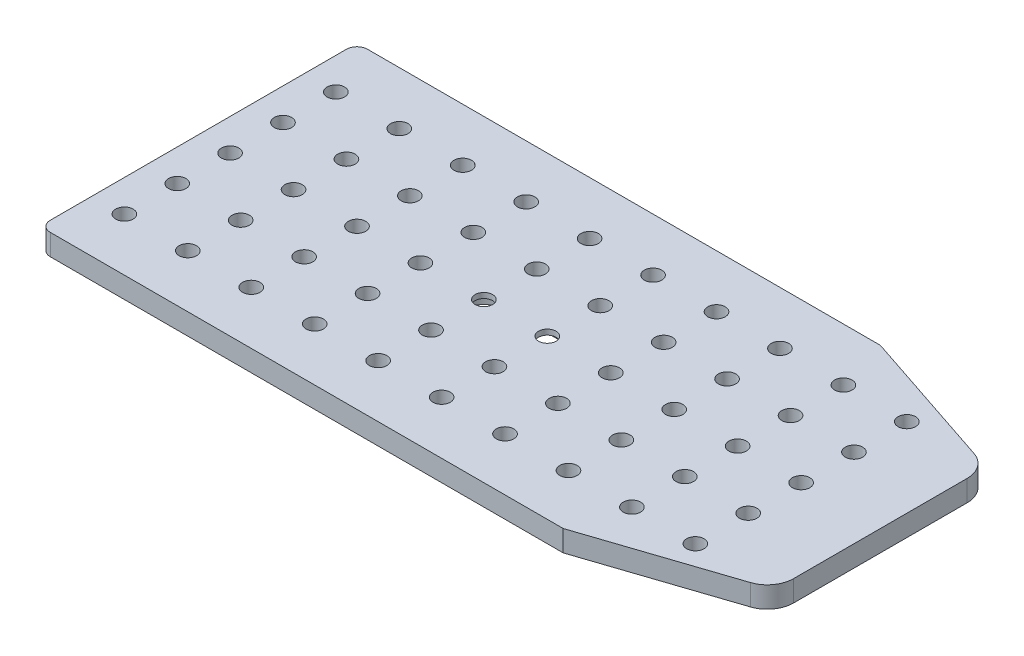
from build123d import *

# Parameters (mm, degrees)
SKETCH1_W           = 150
SKETCH1_H           = 20
BOSS_EXTRUDE1_DEPTH = 4
FILLET1_R           = 5
SKETCH2_R           = 1.65
CUT_EXTRUDE1_DEPTH  = 4
SKETCH3_R           = 2
CUT_EXTRUDE2_DEPTH  = 4
SKETCH4_W           = 62.892009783
SKETCH4_H           = 15
CUT_EXTRUDE3_DEPTH  = 33
FILLET2_R           = 5
CUT_EXTRUDE4_DEPTH  = 3
BOSS_EXTRUDE2_DEPTH = 4
FILLET3_R           = 5
SKETCH16_R          = 1.65
CUT_EXTRUDE5_DEPTH  = 3
CUT_EXTRUDE6_DEPTH  = 3
FILLET4_R           = 5
SKETCH19_W          = 109.521719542
SKETCH19_H          = 24.424509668
SKETCH19_W_2        = 104.116545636
SKETCH19_H_2        = 30.575224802
CUT_EXTRUDE7_DEPTH  = 20
SKETCH20_W          = 63.558931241
SKETCH20_H          = 81.151506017
CUT_EXTRUDE8_DEPTH  = 10
FILLET5_R           = 2


with BuildPart() as part:
    # Sketch1 → Boss-Extrude1 (new body)
    with BuildSketch(Plane(origin=(0, 0, 0), x_dir=(1, 0, 0), z_dir=(0, 1, 0))):
        Polygon((-75, 45), (-75, 25), (-22.5, 25), (75, 25), (75, 45), align=None)
        Polygon((-22.5, 25), (-75, 25), (-75, -25), (75, -25), (75, 25), align=None)
        with Locations((0, -35)):
            Rectangle(SKETCH1_W, SKETCH1_H)
    extrude(amount=BOSS_EXTRUDE1_DEPTH)

    # Fillet1
    fillet1_edges = [part.edges().sort_by_distance(p)[0] for p in [
        (-75, 2, -45),
        (75, 2, -45),
        (75, 2, 45),
        (-75, 2, 45),
    ]]
    fillet(fillet1_edges, radius=FILLET1_R)

    # Sketch2 → Cut-Extrude1 (cut, symmetric)
    with BuildSketch(Plane(origin=(0, 4, 0), x_dir=(1, 0, 0), z_dir=(0, 1, 0))):
        with Locations(Location((-50, 10, 0), (0, 0, 270))):
            Circle(SKETCH2_R)
        with Locations(Location((-60, 10, 0), (0, 0, 270))):
            Circle(SKETCH2_R)
        with BuildLine():
            ThreePointArc((-68.35, 10), (-68.833273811, 11.166726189), (-70, 11.65))
            Line((-70, 11.65), (-70, 8.35))
            ThreePointArc((-70, 8.35), (-68.833273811, 8.833273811), (-68.35, 10))
        make_face()
        with BuildLine():
            Line((-70, 8.35), (-70, 11.65))
            ThreePointArc((-70, 11.65), (-71.65, 10), (-70, 8.35))
        make_face()
        with BuildLine():
            ThreePointArc((-68.35, 10), (-68.833273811, 11.166726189), (-70, 11.65))
            Line((-70, 11.65), (-70, 8.35))
            ThreePointArc((-70, 8.35), (-68.833273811, 8.833273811), (-68.35, 10))
        make_face()
        with BuildLine():
            Line((-70, 8.35), (-70, 11.65))
            ThreePointArc((-70, 11.65), (-71.65, 10), (-70, 8.35))
        make_face()
        with BuildLine():
            ThreePointArc((-28.35, 0), (-28.833273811, 1.166726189), (-30, 1.65))
            Line((-30, 1.65), (-30, -1.65))
            ThreePointArc((-30, -1.65), (-28.833273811, -1.166726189), (-28.35, 0))
        make_face()
        with BuildLine():
            Line((-30, -1.65), (-30, 1.65))
            ThreePointArc((-30, 1.65), (-31.65, 0), (-30, -1.65))
        make_face()
        with BuildLine():
            ThreePointArc((-28.35, 0), (-28.833273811, 1.166726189), (-30, 1.65))
            Line((-30, 1.65), (-30, -1.65))
            ThreePointArc((-30, -1.65), (-28.833273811, -1.166726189), (-28.35, 0))
        make_face()
        with BuildLine():
            Line((-30, -1.65), (-30, 1.65))
            ThreePointArc((-30, 1.65), (-31.65, 0), (-30, -1.65))
        make_face()
        with Locations(Location((-40, 0, 0), (0, 0, 270))):
            Circle(SKETCH2_R)
        with Locations(Location((-50, 0, 0), (0, 0, 270))):
            Circle(SKETCH2_R)
        with Locations(Location((-60, 0, 0), (0, 0, 270))):
            Circle(SKETCH2_R)
        with BuildLine():
            ThreePointArc((-68.35, 0), (-68.833273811, 1.166726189), (-70, 1.65))
            Line((-70, 1.65), (-70, -1.65))
            ThreePointArc((-70, -1.65), (-68.833273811, -1.166726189), (-68.35, 0))
        make_face()
        with BuildLine():
            Line((-70, -1.65), (-70, 1.65))
            ThreePointArc((-70, 1.65), (-71.65, 0), (-70, -1.65))
        make_face()
        with BuildLine():
            ThreePointArc((-68.35, 0), (-68.833273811, 1.166726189), (-70, 1.65))
            Line((-70, 1.65), (-70, -1.65))
            ThreePointArc((-70, -1.65), (-68.833273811, -1.166726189), (-68.35, 0))
        make_face()
        with BuildLine():
            Line((-70, -1.65), (-70, 1.65))
            ThreePointArc((-70, 1.65), (-71.65, 0), (-70, -1.65))
        make_face()
        with BuildLine():
            ThreePointArc((-68.35, -10), (-68.833273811, -8.833273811), (-70, -8.35))
            Line((-70, -8.35), (-70, -11.65))
            ThreePointArc((-70, -11.65), (-68.833273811, -11.166726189), (-68.35, -10))
        make_face()
        with BuildLine():
            Line((-70, -11.65), (-70, -8.35))
            ThreePointArc((-70, -8.35), (-71.65, -10), (-70, -11.65))
        make_face()
        with BuildLine():
            ThreePointArc((-68.35, -10), (-68.833273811, -8.833273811), (-70, -8.35))
            Line((-70, -8.35), (-70, -11.65))
            ThreePointArc((-70, -11.65), (-68.833273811, -11.166726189), (-68.35, -10))
        make_face()
        with BuildLine():
            Line((-70, -11.65), (-70, -8.35))
            ThreePointArc((-70, -8.35), (-71.65, -10), (-70, -11.65))
        make_face()
        with Locations(Location((-60, -10, 0), (0, 0, 270))):
            Circle(SKETCH2_R)
        with Locations(Location((-50, -10, 0), (0, 0, 270))):
            Circle(SKETCH2_R)
        with Locations(Location((-40, -10, 0), (0, 0, 270))):
            Circle(SKETCH2_R)
        with BuildLine():
            ThreePointArc((-28.35, -10), (-28.833273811, -8.833273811), (-30, -8.35))
            Line((-30, -8.35), (-30, -11.65))
            ThreePointArc((-30, -11.65), (-28.833273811, -11.166726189), (-28.35, -10))
        make_face()
        with BuildLine():
            Line((-30, -11.65), (-30, -8.35))
            ThreePointArc((-30, -8.35), (-31.65, -10), (-30, -11.65))
        make_face()
        with BuildLine():
            ThreePointArc((-28.35, -10), (-28.833273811, -8.833273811), (-30, -8.35))
            Line((-30, -8.35), (-30, -11.65))
            ThreePointArc((-30, -11.65), (-28.833273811, -11.166726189), (-28.35, -10))
        make_face()
        with BuildLine():
            Line((-30, -11.65), (-30, -8.35))
            ThreePointArc((-30, -8.35), (-31.65, -10), (-30, -11.65))
        make_face()
        with BuildLine():
            ThreePointArc((-28.35, -20), (-28.833273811, -18.833273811), (-30, -18.35))
            Line((-30, -18.35), (-30, -20))
            Line((-30, -20), (-31.65, -20))
            ThreePointArc((-31.65, -20), (-30, -21.65), (-28.35, -20))
        make_face()
        with BuildLine():
            Line((-30, -20), (-30, -18.35))
            ThreePointArc((-30, -18.35), (-31.166726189, -18.833273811), (-31.65, -20))
            Line((-31.65, -20), (-30, -20))
        make_face()
        with BuildLine():
            ThreePointArc((-28.35, -20), (-28.833273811, -18.833273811), (-30, -18.35))
            Line((-30, -18.35), (-30, -20))
            Line((-30, -20), (-31.65, -20))
            ThreePointArc((-31.65, -20), (-30, -21.65), (-28.35, -20))
        make_face()
        with BuildLine():
            Line((-30, -20), (-30, -18.35))
            ThreePointArc((-30, -18.35), (-31.166726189, -18.833273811), (-31.65, -20))
            Line((-31.65, -20), (-30, -20))
        make_face()
        with BuildLine():
            ThreePointArc((-38.35, -20), (-40, -18.35), (-41.65, -20))
            Line((-41.65, -20), (-38.35, -20))
        make_face()
        with BuildLine():
            Line((-38.35, -20), (-41.65, -20))
            ThreePointArc((-41.65, -20), (-40, -21.65), (-38.35, -20))
        make_face()
        with BuildLine():
            ThreePointArc((-38.35, -20), (-40, -18.35), (-41.65, -20))
            Line((-41.65, -20), (-38.35, -20))
        make_face()
        with BuildLine():
            Line((-38.35, -20), (-41.65, -20))
            ThreePointArc((-41.65, -20), (-40, -21.65), (-38.35, -20))
        make_face()
        with BuildLine():
            ThreePointArc((-48.35, -20), (-50, -18.35), (-51.65, -20))
            Line((-51.65, -20), (-48.35, -20))
        make_face()
        with BuildLine():
            Line((-48.35, -20), (-51.65, -20))
            ThreePointArc((-51.65, -20), (-50, -21.65), (-48.35, -20))
        make_face()
        with BuildLine():
            ThreePointArc((-48.35, -20), (-50, -18.35), (-51.65, -20))
            Line((-51.65, -20), (-48.35, -20))
        make_face()
        with BuildLine():
            Line((-48.35, -20), (-51.65, -20))
            ThreePointArc((-51.65, -20), (-50, -21.65), (-48.35, -20))
        make_face()
        with BuildLine():
            ThreePointArc((-58.35, -20), (-60, -18.35), (-61.65, -20))
            Line((-61.65, -20), (-58.35, -20))
        make_face()
        with BuildLine():
            Line((-58.35, -20), (-61.65, -20))
            ThreePointArc((-61.65, -20), (-60, -21.65), (-58.35, -20))
        make_face()
        with BuildLine():
            ThreePointArc((-58.35, -20), (-60, -18.35), (-61.65, -20))
            Line((-61.65, -20), (-58.35, -20))
        make_face()
        with BuildLine():
            Line((-58.35, -20), (-61.65, -20))
            ThreePointArc((-61.65, -20), (-60, -21.65), (-58.35, -20))
        make_face()
        with Locations(Location((-18, -20, 0), (0, 0, 270))):
            Circle(SKETCH2_R)
        with Locations(Location((-18, -10, 0), (0, 0, 270))):
            Circle(SKETCH2_R)
        with Locations(Location((-18, 0, 0), (0, 0, 270))):
            Circle(SKETCH2_R)
        with Locations(Location((-18, 10, 0), (0, 0, 270))):
            Circle(SKETCH2_R)
        with Locations(Location((-18, 20, 0), (0, 0, 270))):
            Circle(SKETCH2_R)
        with Locations(Location((-6, 20, 0), (0, 0, 270))):
            Circle(SKETCH2_R)
        with Locations(Location((6, 20, 0), (0, 0, 270))):
            Circle(SKETCH2_R)
        with Locations(Location((18, 20, 0), (0, 0, 270))):
            Circle(SKETCH2_R)
        with Locations(Location((-6, 10, 0), (0, 0, 270))):
            Circle(SKETCH2_R)
        with Locations(Location((6, 10, 0), (0, 0, 270))):
            Circle(SKETCH2_R)
        with Locations(Location((18, 10, 0), (0, 0, 270))):
            Circle(SKETCH2_R)
        with Locations(Location((30, 10, 0), (0, 0, 270))):
            Circle(SKETCH2_R)
        with Locations(Location((42, 10, 0), (0, 0, 270))):
            Circle(SKETCH2_R)
        with Locations(Location((54, 10, 0), (0, 0, 270))):
            Circle(SKETCH2_R)
        with Locations(Location((54, 0, 0), (0, 0, 270))):
            Circle(SKETCH2_R)
        with Locations(Location((54, -10, 0), (0, 0, 270))):
            Circle(SKETCH2_R)
        with Locations(Location((54, -20, 0), (0, 0, 270))):
            Circle(SKETCH2_R)
        with Locations(Location((42, -20, 0), (0, 0, 270))):
            Circle(SKETCH2_R)
        with Locations(Location((42, 0, 0), (0, 0, 270))):
            Circle(SKETCH2_R)
        with Locations(Location((30, -10, 0), (0, 0, 270))):
            Circle(SKETCH2_R)
        with Locations(Location((30, 0, 0), (0, 0, 270))):
            Circle(SKETCH2_R)
        with Locations(Location((30, -20, 0), (0, 0, 270))):
            Circle(SKETCH2_R)
        with Locations(Location((18, -20, 0), (0, 0, 270))):
            Circle(SKETCH2_R)
        with Locations(Location((-6, -20, 0), (0, 0, 270))):
            Circle(SKETCH2_R)
        with Locations(Location((-6, -10, 0), (0, 0, 270))):
            Circle(SKETCH2_R)
        with Locations(Location((-6, 0, 0), (0, 0, 270))):
            Circle(SKETCH2_R)
        with Locations(Location((6, 0, 0), (0, 0, 270))):
            Circle(SKETCH2_R)
        with Locations(Location((6, -10, 0), (0, 0, 270))):
            Circle(SKETCH2_R)
        with Locations(Location((6, -20, 0), (0, 0, 270))):
            Circle(SKETCH2_R)
        with Locations(Location((18, -10, 0), (0, 0, 270))):
            Circle(SKETCH2_R)
        with Locations(Location((18, 0, 0), (0, 0, 270))):
            Circle(SKETCH2_R)
        with Locations(Location((30, 20, 0), (0, 0, 270))):
            Circle(SKETCH2_R)
        with Locations(Location((42, 20, 0), (0, 0, 270))):
            Circle(SKETCH2_R)
        with Locations(Location((54, 20, 0), (0, 0, 270))):
            Circle(SKETCH2_R)
        with Locations(Location((-60, 20, 0), (0, 0, 270))):
            Circle(SKETCH2_R)
        with Locations(Location((-50, 20, 0), (0, 0, 270))):
            Circle(SKETCH2_R)
        with Locations(Location((-40, 20, 0), (0, 0, 270))):
            Circle(SKETCH2_R)
        with Locations(Location((-30, 20, 0), (0, 0, 270))):
            Circle(SKETCH2_R)
        with Locations(Location((-30, 10, 0), (0, 0, 270))):
            Circle(SKETCH2_R)
        with Locations(Location((-40, 10, 0), (0, 0, 270))):
            Circle(SKETCH2_R)
        with Locations(Location((-70, -20, 0), (0, 0, 270))):
            Circle(SKETCH2_R)
        with Locations(Location((42, -10, 0), (0, 0, 270))):
            Circle(SKETCH2_R)
        with Locations(Location((-70, 20, 0), (0, 0, 270))):
            Circle(SKETCH2_R)
    extrude(amount=CUT_EXTRUDE1_DEPTH, both=True, mode=Mode.SUBTRACT)

    # Sketch3 → Cut-Extrude2 (cut, symmetric)
    with BuildSketch(Plane(origin=(0, 4, 0), x_dir=(1, 0, 0), z_dir=(0, 1, 0))):
        with Locations(Location((-70, 20, 0), (0, 0, 270))):
            Circle(SKETCH3_R)
    extrude(amount=CUT_EXTRUDE2_DEPTH, both=True, mode=Mode.SUBTRACT)

    # Sketch4 → Cut-Extrude3 (cut)
    with BuildSketch(Plane(origin=(0, 4, 0), x_dir=(1, 0, 0), z_dir=(0, 1, 0))):
        with Locations((-56.446004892, -37.5)):
            Rectangle(SKETCH4_W, SKETCH4_H)
        with Locations((-56.446004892, 37.5)):
            Rectangle(SKETCH4_W, SKETCH4_H)
    extrude(amount=-CUT_EXTRUDE3_DEPTH, mode=Mode.SUBTRACT)

    # Fillet2
    fillet2_edges = [part.edges().sort_by_distance(p)[0] for p in [
        (-25, 2, -45),
        (-25, 2, 45),
    ]]
    fillet(fillet2_edges, radius=FILLET2_R)

    # Sketch14 → Cut-Extrude4 (cut)
    with BuildSketch(Plane(origin=(0, 4, 0), x_dir=(1, 0, 0), z_dir=(0, 1, 0))):
        with BuildLine():
            ThreePointArc((15, 36), (17.121320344, 36.878679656), (18, 39))
            Line((18, 39), (-18, 39))
            ThreePointArc((-18, 39), (-17.121320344, 36.878679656), (-15, 36))
            Line((-15, 36), (15, 36))
        make_face()
        with BuildLine():
            Line((-18, 39), (18, 39))
            ThreePointArc((18, 39), (17.121320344, 41.121320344), (15, 42))
            Line((15, 42), (-15, 42))
            ThreePointArc((-15, 42), (-17.121320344, 41.121320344), (-18, 39))
        make_face()
        with BuildLine():
            ThreePointArc((35, 36), (32, 39), (35, 42))
            Line((35, 42), (65, 42))
            ThreePointArc((65, 42), (68, 39), (65, 36))
            Line((65, 36), (35, 36))
        make_face()
        with BuildLine():
            ThreePointArc((15, -36), (18, -39), (15, -42))
            Line((15, -42), (-15, -42))
            ThreePointArc((-15, -42), (-18, -39), (-15, -36))
            Line((-15, -36), (15, -36))
        make_face()
        with BuildLine():
            Line((65, -36), (35, -36))
            ThreePointArc((35, -36), (32, -39), (35, -42))
            Line((35, -42), (65, -42))
            ThreePointArc((65, -42), (68, -39), (65, -36))
        make_face()
    extrude(amount=-CUT_EXTRUDE4_DEPTH, mode=Mode.SUBTRACT)

    # Sketch15 → Boss-Extrude2 (add)
    with BuildSketch(Plane(origin=(0, 4, 0), x_dir=(1, 0, 0), z_dir=(0, 1, 0))):
        Polygon((105, 0), (75, 0), (75, -30), (105, -20), align=None)
        Polygon((75, 30), (75, 0), (105, 0), (105, 20), align=None)
    extrude(amount=-BOSS_EXTRUDE2_DEPTH)

    # Fillet3
    fillet3_edges = [part.edges().sort_by_distance(p)[0] for p in [
        (105, 2, -20),
        (105, 2, 20),
    ]]
    fillet(fillet3_edges, radius=FILLET3_R)

    # Sketch16 → Cut-Extrude5 (cut)
    with BuildSketch(Plane(origin=(0, 4, 0), x_dir=(1, 0, 0), z_dir=(0, 1, 0))):
        with Locations(Location((78, 20, 0), (0, 0, 270))):
            Circle(SKETCH16_R)
        with Locations(Location((90, 20, 0), (0, 0, 270))):
            Circle(SKETCH16_R)
        with Locations(Location((66, 10, 0), (0, 0, 270))):
            Circle(SKETCH16_R)
        with Locations(Location((78, 10, 0), (0, 0, 270))):
            Circle(SKETCH16_R)
        with Locations(Location((90, 10, 0), (0, 0, 270))):
            Circle(SKETCH16_R)
        with Locations(Location((90, -10, 0), (0, 0, 270))):
            Circle(SKETCH16_R)
        with Locations(Location((90, -20, 0), (0, 0, 270))):
            Circle(SKETCH16_R)
        with Locations(Location((66, 20, 0), (0, 0, 270))):
            Circle(SKETCH16_R)
        with Locations(Location((90, 0, 0), (0, 0, 270))):
            Circle(SKETCH16_R)
        with Locations(Location((78, 0, 0), (0, 0, 270))):
            Circle(SKETCH16_R)
        with Locations(Location((66, 0, 0), (0, 0, 270))):
            Circle(SKETCH16_R)
        with Locations(Location((66, -10, 0), (0, 0, 270))):
            Circle(SKETCH16_R)
        with Locations(Location((66, -20, 0), (0, 0, 270))):
            Circle(SKETCH16_R)
        with Locations(Location((78, -20, 0), (0, 0, 270))):
            Circle(SKETCH16_R)
        with Locations(Location((78, -10, 0), (0, 0, 270))):
            Circle(SKETCH16_R)
    extrude(amount=-CUT_EXTRUDE5_DEPTH, mode=Mode.SUBTRACT)

    # Sketch18 → Cut-Extrude6 (cut)
    with BuildSketch(Plane(origin=(0, 0, 0), x_dir=(-1, 0, 0), z_dir=(0, -1, 0))):
        with BuildLine():
            Line((-30, -4.5), (-42, -4.5))
            ThreePointArc((-42, -4.5), (-46.5, 0), (-42, 4.5))
            Line((-42, 4.5), (-30, 4.5))
            ThreePointArc((-30, 4.5), (-25.5, 0), (-30, -4.5))
        make_face()
    extrude(amount=-CUT_EXTRUDE6_DEPTH, mode=Mode.SUBTRACT)

    # Fillet4
    fillet4_edges = [part.edges().sort_by_distance(p)[0] for p in [
        (-75, 2, -30),
        (-75, 2, 30),
    ]]
    fillet(fillet4_edges, radius=FILLET4_R)

    # Sketch19 → Cut-Extrude7 (cut)
    with BuildSketch(Plane(origin=(0, 4, 0), x_dir=(1, 0, 0), z_dir=(0, 1, 0))):
        with Locations((29.760859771, 42.212254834)):
            Rectangle(SKETCH19_W, SKETCH19_H)
        with Locations((27.058272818, -45.287612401)):
            Rectangle(SKETCH19_W_2, SKETCH19_H_2)
    extrude(amount=-CUT_EXTRUDE7_DEPTH, mode=Mode.SUBTRACT)

    # Sketch20 → Cut-Extrude8 (cut)
    with BuildSketch(Plane(origin=(0, 4, 0), x_dir=(1, 0, 0), z_dir=(0, 1, 0))):
        with Locations((-55.779465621, -2.286837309)):
            Rectangle(SKETCH20_W, SKETCH20_H)
    extrude(amount=-CUT_EXTRUDE8_DEPTH, mode=Mode.SUBTRACT)

    # Fillet5
    fillet5_edges = [part.edges().sort_by_distance(p)[0] for p in [
        (-24, 2, -30),
        (-24, 2, 30),
    ]]
    fillet(fillet5_edges, radius=FILLET5_R)


solid = part.part
